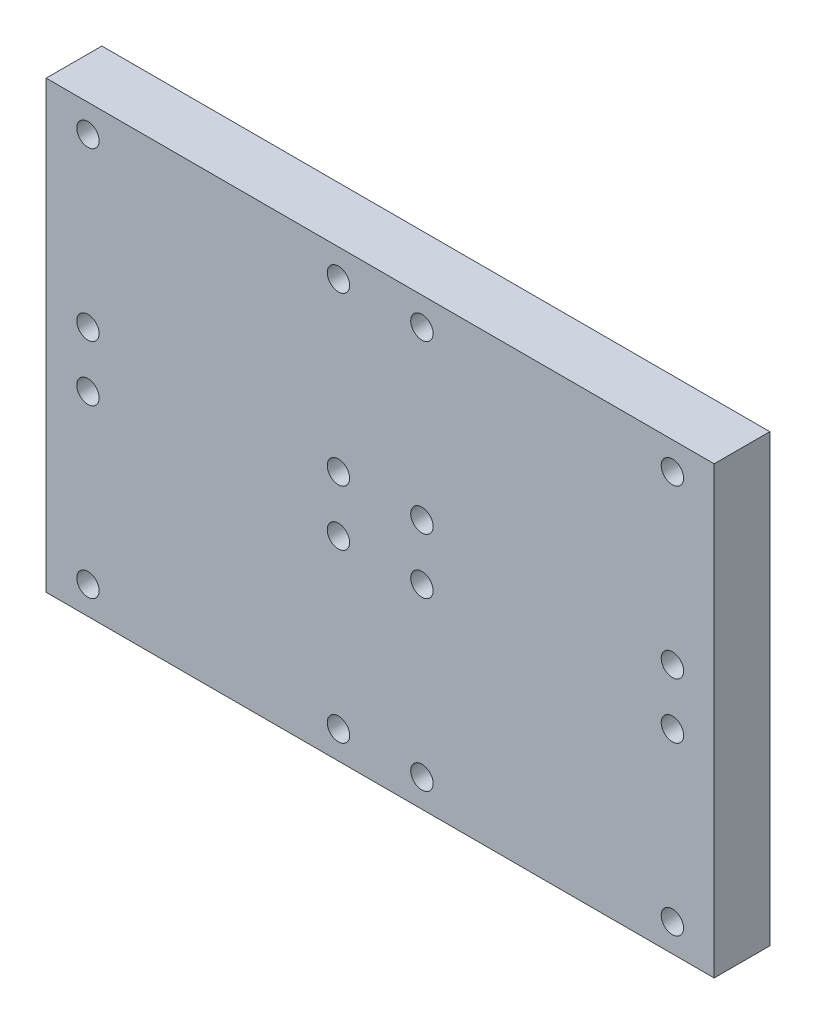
from build123d import *

# Parameters (mm, degrees)
SKETCH1_W               = 152.4
SKETCH1_H               = 101.6
EXTRUDE1_DEPTH          = 12.7
F_1_4_20_TAPPED_HOLE1_D = 5.1054
LPATTERN1_COUNT         = 2
LPATTERN1_PITCH         = 76.2
LPATTERN1_COUNT_DIR2    = 2
LPATTERN1_PITCH_DIR2    = 50.8


with BuildPart() as part:
    # Sketch1 → Extrude1 (new body)
    with BuildSketch(Plane.XY):
        with Locations((76.2, 50.8)):
            Rectangle(SKETCH1_W, SKETCH1_H)
    extrude(amount=EXTRUDE1_DEPTH)

    # 1_4-20 Tapped Hole1 (through all)
    with Locations(Plane.XY.offset(12.7)):
        with Locations((9.525, 6.35), (66.675, 6.35), (66.675, 44.45), (9.525, 44.45)):
            f_1_4_20_tapped_hole1 = Hole(F_1_4_20_TAPPED_HOLE1_D / 2)

    # LPattern1: 1_4-20 Tapped Hole1 2 × 2
    with Locations(*[(i * LPATTERN1_PITCH, j * LPATTERN1_PITCH_DIR2, 0) for i in range(LPATTERN1_COUNT) for j in range(LPATTERN1_COUNT_DIR2) if (i, j) != (0, 0)]):
        add(f_1_4_20_tapped_hole1, mode=Mode.SUBTRACT)


solid = part.part
